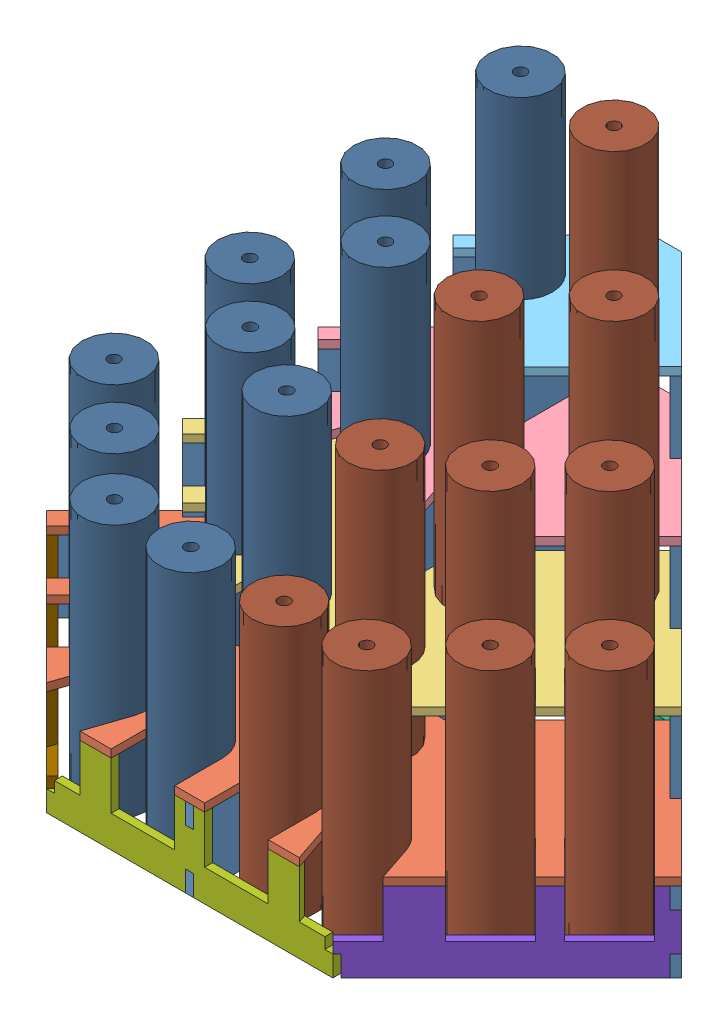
SolidWorks assembly Noodles.SLDASM, configuration Default (file format 3400). Lengths in mm.
Overall size (1013.98 800.1 761.89).
31 component instances, 11 part files, 76 mates.
Components (placement in the parent):
- noodle support-4: noodle support.SLDPRT [Default] at origin size (12.7 508 683.78)
- noodle support-5: noodle support.SLDPRT [Default] at (-52.8468 0 -43.8665) x (0.707107 0 -0.707107) z (0.707107 0 0.707107) size (12.7 508 683.78)
- noodle support-6: noodle support.SLDPRT [Default] at (52.8468 0 -43.8665) x (0.707107 0 0.707107) z (-0.707107 0 0.707107) size (12.7 508 683.78)
- tier1-1: tier1.SLDPRT [Default] at (0 127 0) x (-1 0 0) z (0 1 0) size (1013.98 486.21 12.7)
- tier2-2: tier2.SLDPRT [Default] at (0 254 0) x (-1 0 0) z (0 1 0) size (797.17 440.67 12.7)
- tier3-1: tier3.SLDPRT [Default] at (0 381 0) x (-1 0 0) z (0 1 0) size (580.37 377.17 12.7)
- tier4-2: tier4.SLDPRT [Default] at (0 508 0) x (-1 0 0) z (0 1 0) size (364.47 302.62 12.7)
- noodle base-1: noodle base.SLDPRT [Default] x (1 0 0) z (0 -1 0) size (315.85 152.4 12.7)
- front-1: front.SLDPRT [Default] at (0 0 772.6759) size (457.2 127 12.7)
- right side-1: right side.SLDPRT [Default] at (518.3404 -98.1886 495.6355) x (0.707107 0 -0.707107) z (0.707107 0 0.707107) size (393.7 127 12.7)
- left side-1: left side.SLDPRT [Default] at (-506.9879 0 506.9879) x (0.707107 0 0.707107) z (-0.707107 0 0.707107) size (393.7 127 12.7)
- blue_noodle-1: blue_noodle.SLDPRT [Default] at (-74.6592 203.2 709.1759) x (1 0 0) z (0 -1 0) size (101.6 101.6 406.4)
- blue_noodle-2: blue_noodle.SLDPRT [Default] at (-300.1229 203.2 605.4517) x (1 0 0) z (0 -1 0) size (101.6 101.6 406.4)
- blue_noodle-3: blue_noodle.SLDPRT [Default] at (-201.3401 203.2 704.2345) x (1 0 0) z (0 -1 0) size (101.6 101.6 406.4)
- blue_noodle-4: blue_noodle.SLDPRT [Default] at (-191.7217 342.9 497.0504) x (1 0 0) z (0 -1 0) size (101.6 101.6 406.4)
- blue_noodle-5: blue_noodle.SLDPRT [Default] at (-395.8242 203.2 510.3886) x (1 0 0) z (0 -1 0) size (101.6 101.6 406.4)
- blue_noodle-6: blue_noodle.SLDPRT [Default] at (-74.6592 469.9 397.9485) x (1 0 0) z (0 -1 0) size (101.6 101.6 406.4)
- blue_noodle-7: blue_noodle.SLDPRT [Default] at (-74.6592 342.9 555.8733) x (1 0 0) z (0 -1 0) size (101.6 101.6 406.4)
- blue_noodle-8: blue_noodle.SLDPRT [Default] at (-74.6592 596.9 182.4223) x (1 0 0) z (0 -1 0) size (101.6 101.6 406.4)
- blue_noodle-9: blue_noodle.SLDPRT [Default] at (-287.4229 342.9 401.9873) x (1 0 0) z (0 -1 0) size (101.6 101.6 406.4)
- blue_noodle-10: blue_noodle.SLDPRT [Default] at (-182.4223 469.9 290.1854) x (1 0 0) z (0 -1 0) size (101.6 101.6 406.4)
- yellow_noodle-1: yellow_noodle.SLDPRT [Default] at (395.8242 203.2 510.3886) x (0.986353 0 0.164644) z (0 -1 0) size (101.6 101.6 406.4)
- yellow_noodle-2: yellow_noodle.SLDPRT [Default] at (287.4229 342.9 401.9873) x (1 0 0) z (0 -1 0) size (101.6 101.6 406.4)
- yellow_noodle-3: yellow_noodle.SLDPRT [Default] at (201.3401 203.2 704.2345) x (0.934176 0 0.356812) z (0 -1 0) size (101.6 101.6 406.4)
- yellow_noodle-4: yellow_noodle.SLDPRT [Default] at (191.7217 342.9 497.0504) x (1 0 0) z (0 -1 0) size (101.6 101.6 406.4)
- yellow_noodle-5: yellow_noodle.SLDPRT [Default] at (300.1229 203.2 605.4517) x (-0.950151 0 -0.311791) z (0 -1 0) size (101.6 101.6 406.4)
- yellow_noodle-6: yellow_noodle.SLDPRT [Default] at (74.6592 203.2 709.1759) x (0.984535 0 0.175189) z (0 -1 0) size (101.6 101.6 406.4)
- yellow_noodle-7: yellow_noodle.SLDPRT [Default] at (74.6592 342.9 555.8733) x (0.983169 0 0.1827) z (0 -1 0) size (101.6 101.6 406.4)
- yellow_noodle-8: yellow_noodle.SLDPRT [Default] at (182.4223 469.9 290.1854) x (1 0 0) z (0 -1 0) size (101.6 101.6 406.4)
- yellow_noodle-9: yellow_noodle.SLDPRT [Default] at (74.6592 596.9 182.4223) x (0.315011 0 -0.949088) z (0 -1 0) size (101.6 101.6 406.4)
- yellow_noodle-10: yellow_noodle.SLDPRT [Default] at (74.6592 469.9 397.9485) x (1 0 0) z (0 -1 0) size (101.6 101.6 406.4)
Mates (geometry in assembly coordinates):
- Coincident3: coincident anti-aligned: line of noodle support-4; line of noodle support-5
- Coincident4: coincident: point of noodle support-5; point of noodle support-4
- Coincident6: coincident aligned: plane of noodle support-4 through (0 0 0) normal (0 1 0); plane of noodle support-5 through (-52.8468 0 -43.8665) normal (0 1 0)
- Coincident7: coincident anti-aligned: line of noodle support-4; line of noodle support-6
- Coincident8: coincident: point of noodle support-4; line of noodle support-6
- Coincident12: coincident aligned: plane of noodle support-4 through (0 0 0) normal (0 1 0); plane of noodle support-6 through (52.8468 0 -43.8665) normal (0 1 0)
- InPlace1: in place: moOrthogonalPlaneRef_w of noodle support-4; unknown of tier1-1
- Coincident13: coincident aligned: plane of ?; plane of ?
- Coincident14: coincident aligned: moOrthogonalPlaneRef_w of ?; plane of ?
- Coincident15: coincident anti-aligned: moOrthogonalPlaneRef_w of ?; plane of ?
- InPlace3: in place: unknown of noodle support-4; unknown of tier2-2
- Coincident19: coincident aligned: plane of ?; plane of ?
- Coincident20: coincident aligned: moOrthogonalPlaneRef_w of ?; plane of ?
- Coincident21: coincident anti-aligned: moOrthogonalPlaneRef_w of ?; plane of ?
- InPlace4: in place: unknown of noodle support-4; unknown of tier3-1
- Coincident22: coincident aligned: plane of ?; plane of ?
- Coincident23: coincident aligned: moOrthogonalPlaneRef_w of ?; plane of ?
- Coincident24: coincident anti-aligned: moOrthogonalPlaneRef_w of ?; plane of ?
- InPlace5: in place: unknown of noodle support-4; unknown of tier4-2
- Coincident13: coincident aligned: plane of ?; plane of ?
- Coincident14: coincident aligned: moOrthogonalPlaneRef_w of ?; plane of ?
- Coincident15: coincident anti-aligned: moOrthogonalPlaneRef_w of ?; plane of ?
- InPlace6: in place: unknown of noodle support-4; unknown of noodle base-1
- Coincident13: coincident aligned: plane of ?; plane of ?
- Coincident14: coincident aligned: moOrthogonalPlaneRef_w of ?; plane of ?
- Coincident15: coincident anti-aligned: moOrthogonalPlaneRef_w of ?; plane of ?
- InPlace7: in place: unknown of noodle support-4; unknown of front-1
- Coincident13: coincident aligned: plane of ?; plane of ?
- Coincident14: coincident aligned: moOrthogonalPlaneRef_w of ?; plane of ?
- Coincident15: coincident anti-aligned: moOrthogonalPlaneRef_w of ?; plane of ?
- Concentric1: concentric anti-aligned: cylinder of tier1-1; cylinder of yellow_noodle-1
- Concentric2: concentric anti-aligned: cylinder of tier1-1; cylinder of yellow_noodle-5
- Concentric3: concentric anti-aligned: cylinder of tier1-1; cylinder of yellow_noodle-3
- Concentric4: concentric anti-aligned: cylinder of tier1-1; cylinder of yellow_noodle-6
- Concentric5: concentric anti-aligned: cylinder of tier2-2; cylinder of yellow_noodle-2
- Concentric6: concentric anti-aligned: cylinder of tier2-2; cylinder of yellow_noodle-4
- Concentric7: concentric anti-aligned: cylinder of tier2-2; cylinder of yellow_noodle-7
- Concentric8: concentric anti-aligned: cylinder of tier3-1; cylinder of yellow_noodle-8
- Concentric9: concentric anti-aligned: cylinder of tier3-1; cylinder of yellow_noodle-10
- Concentric10: concentric anti-aligned: cylinder of tier4-2; cylinder of yellow_noodle-9
- Coincident15: coincident aligned: plane of noodle support-5 through (23.4854 0 23.4854) normal (0 -1 0); plane of yellow_noodle-1 through (395.8242 0 510.3886) normal (0 -1 0)
- Coincident16: coincident aligned: plane of yellow_noodle-1 through (395.8242 0 510.3886) normal (0 -1 0); plane of yellow_noodle-5 through (300.1229 0 605.4517) normal (0 -1 0)
- Coincident17: coincident aligned: plane of yellow_noodle-3 through (201.3401 0 704.2345) normal (0 -1 0); plane of yellow_noodle-5 through (300.1229 0 605.4517) normal (0 -1 0)
- Coincident19: coincident aligned: plane of yellow_noodle-3 through (201.3401 0 704.2345) normal (0 -1 0); plane of yellow_noodle-6 through (74.6592 0 709.1759) normal (0 -1 0)
- Coincident20: coincident anti-aligned: plane of tier1-1 through (-290.1854 139.7 290.1854) normal (0 1 0); plane of yellow_noodle-2 through (287.4229 139.7 401.9873) normal (0 -1 0)
- Coincident21: coincident anti-aligned: plane of tier1-1 through (-290.1854 139.7 290.1854) normal (0 1 0); plane of yellow_noodle-4 through (191.7217 139.7 497.0504) normal (0 -1 0)
- Coincident22: coincident anti-aligned: plane of tier1-1 through (-290.1854 139.7 290.1854) normal (0 1 0); plane of yellow_noodle-7 through (74.6592 139.7 555.8733) normal (0 -1 0)
- Coincident23: coincident anti-aligned: plane of tier2-2 through (6.35 266.7 478.7708) normal (0 1 0); plane of yellow_noodle-8 through (182.4223 266.7 290.1854) normal (0 -1 0)
- Coincident24: coincident anti-aligned: plane of tier2-2 through (6.35 266.7 478.7708) normal (0 1 0); plane of yellow_noodle-10 through (74.6592 266.7 397.9485) normal (0 -1 0)
- Coincident26: coincident anti-aligned: plane of tier3-1 through (0 393.7 364.4708) normal (0 1 0); plane of yellow_noodle-9 through (74.6592 393.7 182.4223) normal (0 -1 0)
- Concentric13: concentric anti-aligned: cylinder of tier1-1; cylinder of blue_noodle-1
- Concentric14: concentric anti-aligned: cylinder of tier1-1; cylinder of blue_noodle-3
- Concentric15: concentric anti-aligned: cylinder of tier1-1; cylinder of blue_noodle-2
- Concentric16: concentric anti-aligned: cylinder of tier1-1; cylinder of blue_noodle-5
- Concentric17: concentric anti-aligned: cylinder of tier2-2; cylinder of blue_noodle-7
- Concentric18: concentric anti-aligned: cylinder of tier2-2; cylinder of blue_noodle-4
- Concentric19: concentric anti-aligned: cylinder of tier2-2; cylinder of blue_noodle-9
- Concentric20: concentric anti-aligned: cylinder of tier3-1; cylinder of blue_noodle-6
- Concentric21: concentric anti-aligned: cylinder of tier3-1; cylinder of blue_noodle-10
- Concentric22: concentric anti-aligned: cylinder of tier4-2; cylinder of blue_noodle-8
- Coincident27: coincident aligned: plane of noodle support-6 through (-14.5051 0 32.4656) normal (0 -1 0); plane of blue_noodle-5 through (-395.8242 0 510.3886) normal (0 -1 0)
- Coincident28: coincident aligned: plane of blue_noodle-2 through (-300.1229 0 605.4517) normal (0 -1 0); plane of blue_noodle-5 through (-395.8242 0 510.3886) normal (0 -1 0)
- Coincident29: coincident aligned: plane of blue_noodle-2 through (-300.1229 0 605.4517) normal (0 -1 0); plane of blue_noodle-3 through (-201.3401 0 704.2345) normal (0 -1 0)
- Coincident30: coincident aligned: plane of blue_noodle-1 through (-74.6592 0 709.1759) normal (0 -1 0); plane of blue_noodle-3 through (-201.3401 0 704.2345) normal (0 -1 0)
- Coincident31: coincident anti-aligned: plane of tier1-1 through (-290.1854 139.7 290.1854) normal (0 1 0); plane of blue_noodle-9 through (-287.4229 139.7 401.9873) normal (0 -1 0)
- Coincident32: coincident anti-aligned: plane of tier1-1 through (-290.1854 139.7 290.1854) normal (0 1 0); plane of blue_noodle-4 through (-191.7217 139.7 497.0504) normal (0 -1 0)
- Coincident33: coincident anti-aligned: plane of blue_noodle-7 through (-74.6592 139.7 555.8733) normal (0 -1 0); plane of tier1-1 through (-290.1854 139.7 290.1854) normal (0 1 0)
- Coincident34: coincident anti-aligned: plane of blue_noodle-10 through (-182.4223 266.7 290.1854) normal (0 -1 0); plane of tier2-2 through (6.35 266.7 478.7708) normal (0 1 0)
- Coincident35: coincident anti-aligned: plane of tier2-2 through (6.35 266.7 478.7708) normal (0 1 0); plane of blue_noodle-6 through (-74.6592 266.7 397.9485) normal (0 -1 0)
- Coincident36: coincident anti-aligned: plane of tier3-1 through (0 393.7 364.4708) normal (0 1 0); plane of blue_noodle-8 through (-74.6592 393.7 182.4223) normal (0 -1 0)
- Coincident37: coincident anti-aligned: line of tier1-1; line of right side-1
- Coincident38: coincident aligned: plane of tier1-1 through (506.9879 139.7 506.9879) normal (0.707107 0 0.707107); plane of right side-1 through (498.0077 33.1905 515.9682) normal (0.707107 0 0.707107)
- Coincident40: coincident anti-aligned: line of noodle support-5; line of right side-1
- Coincident41: coincident anti-aligned: line of tier1-1; line of left side-1
- Coincident42: coincident aligned: plane of tier1-1 through (-506.9879 139.7 506.9879) normal (-0.707107 0 0.707107); plane of left side-1 through (-506.9879 33.1905 506.9879) normal (-0.707107 0 0.707107)
- Coincident43: coincident aligned: line of noodle support-6; line of left side-1
